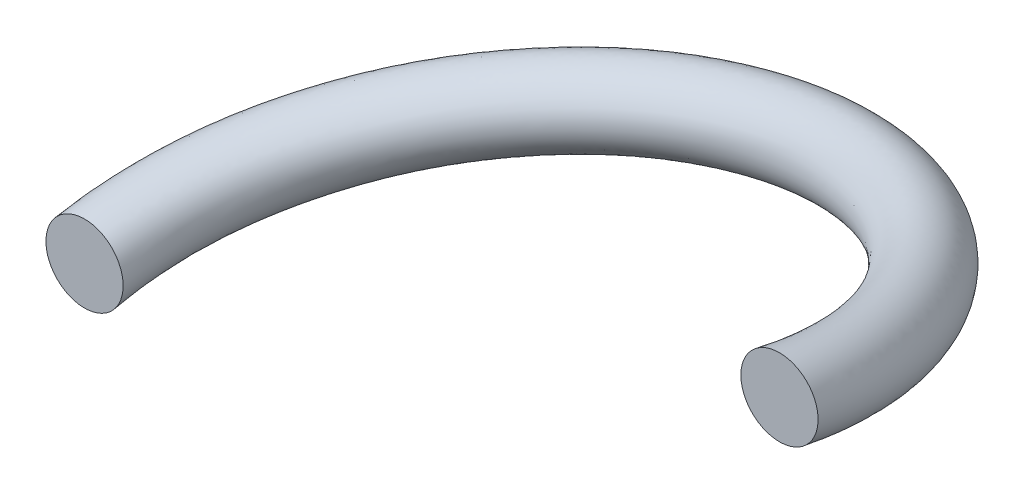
ISO-10303-21;
HEADER;
FILE_DESCRIPTION(('STEP AP214'),'2;1');
FILE_NAME('part.step','',(''),(''),'','','');
FILE_SCHEMA(('AUTOMOTIVE_DESIGN { 1 0 10303 214 1 1 1 1 }'));
ENDSEC;
DATA;
#1=APPLICATION_CONTEXT('core data for automotive mechanical design processes');
#2=APPLICATION_PROTOCOL_DEFINITION('international standard','automotive_design',2000,#1);
#3=PRODUCT_CONTEXT('',#1,'mechanical');
#4=PRODUCT('Part','Part','',(#3));
#5=PRODUCT_RELATED_PRODUCT_CATEGORY('part','',(#4));
#6=PRODUCT_DEFINITION_FORMATION('','',#4);
#7=PRODUCT_DEFINITION_CONTEXT('part definition',#1,'design');
#8=PRODUCT_DEFINITION('design','',#6,#7);
#9=PRODUCT_DEFINITION_SHAPE('','',#8);
#10=(LENGTH_UNIT() NAMED_UNIT(*) SI_UNIT(.MILLI.,.METRE.));
#11=(NAMED_UNIT(*) PLANE_ANGLE_UNIT() SI_UNIT($,.RADIAN.));
#12=(NAMED_UNIT(*) SI_UNIT($,.STERADIAN.) SOLID_ANGLE_UNIT());
#13=UNCERTAINTY_MEASURE_WITH_UNIT(LENGTH_MEASURE(1.E-05),#10,'distance_accuracy_value','');
#14=(GEOMETRIC_REPRESENTATION_CONTEXT(3) GLOBAL_UNCERTAINTY_ASSIGNED_CONTEXT((#13)) GLOBAL_UNIT_ASSIGNED_CONTEXT((#10,
#11,#12)) REPRESENTATION_CONTEXT('',''));
#15=CARTESIAN_POINT('',(0.,0.,0.));
#16=DIRECTION('',(0.,0.,1.));
#17=DIRECTION('',(1.,0.,0.));
#18=AXIS2_PLACEMENT_3D('',#15,#16,#17);
#19=CARTESIAN_POINT('',(-45.,5.,0.));
#20=DIRECTION('',(0.,0.,1.));
#21=DIRECTION('',(1.,0.,0.));
#22=AXIS2_PLACEMENT_3D('',#19,#20,#21);
#23=PLANE('',#22);
#24=CARTESIAN_POINT('',(-45.,5.,0.));
#25=DIRECTION('',(0.,0.,1.));
#26=DIRECTION('',(1.,0.,0.));
#27=AXIS2_PLACEMENT_3D('',#24,#25,#26);
#28=CIRCLE('',#27,5.);
#29=CARTESIAN_POINT('',(-40.,5.,0.));
#30=VERTEX_POINT('',#29);
#31=EDGE_CURVE('E38',#30,#30,#28,.T.);
#32=ORIENTED_EDGE('',*,*,#31,.T.);
#33=EDGE_LOOP('',(#32));
#34=FACE_BOUND('',#33,.T.);
#35=ADVANCED_FACE('F30',(#34),#23,.T.);
#36=CARTESIAN_POINT('',(45.,35.,3.14233320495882E-13));
#37=DIRECTION('',(0.,0.,-1.));
#38=DIRECTION('',(-1.,0.,0.));
#39=AXIS2_PLACEMENT_3D('',#36,#37,#38);
#40=PLANE('',#39);
#41=CARTESIAN_POINT('',(45.,35.,3.14233320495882E-13));
#42=DIRECTION('',(0.,0.,-1.));
#43=DIRECTION('',(-1.,0.,0.));
#44=AXIS2_PLACEMENT_3D('',#41,#42,#43);
#45=CIRCLE('',#44,5.);
#46=CARTESIAN_POINT('',(40.,34.9999999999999,1.84579475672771E-13));
#47=VERTEX_POINT('',#46);
#48=EDGE_CURVE('E11',#47,#47,#45,.T.);
#49=ORIENTED_EDGE('',*,*,#48,.F.);
#50=EDGE_LOOP('',(#49));
#51=FACE_BOUND('',#50,.T.);
#52=ADVANCED_FACE('F64',(#51),#40,.F.);
#53=CARTESIAN_POINT('',(-40.,5.,0.));
#54=CARTESIAN_POINT('',(-40.,7.14285714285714,-9.129738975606));
#55=CARTESIAN_POINT('',(-36.0387547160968,9.28571428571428,-17.3553495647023));
#56=CARTESIAN_POINT('',(-32.0775094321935,11.4285714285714,-25.5809601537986));
#57=CARTESIAN_POINT('',(-24.9395920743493,13.5714285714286,-31.2732592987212));
#58=CARTESIAN_POINT('',(-17.8016747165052,15.7142857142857,-36.9655584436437));
#59=CARTESIAN_POINT('',(-8.90083735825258,17.8571428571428,-38.9971164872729));
#60=CARTESIAN_POINT('',(0.,20.,-41.0286745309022));
#61=CARTESIAN_POINT('',(8.90083735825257,22.1428571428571,-38.9971164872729));
#62=CARTESIAN_POINT('',(17.8016747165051,24.2857142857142,-36.9655584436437));
#63=CARTESIAN_POINT('',(24.9395920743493,26.4285714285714,-31.2732592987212));
#64=CARTESIAN_POINT('',(32.0775094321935,28.5714285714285,-25.5809601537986));
#65=CARTESIAN_POINT('',(36.0387547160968,30.7142857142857,-17.3553495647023));
#66=CARTESIAN_POINT('',(40.,32.8571428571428,-9.129738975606));
#67=CARTESIAN_POINT('',(40.,34.9999999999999,0.));
#68=CARTESIAN_POINT('',(40.,37.1428571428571,9.12973897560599));
#69=CARTESIAN_POINT('',(36.0387547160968,39.2857142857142,17.3553495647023));
#70=CARTESIAN_POINT('',(-40.,15.,0.));
#71=CARTESIAN_POINT('',(-40.,17.1428571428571,-9.129738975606));
#72=CARTESIAN_POINT('',(-36.0387547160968,19.2857142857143,-17.3553495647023));
#73=CARTESIAN_POINT('',(-32.0775094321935,21.4285714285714,-25.5809601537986));
#74=CARTESIAN_POINT('',(-24.9395920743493,23.5714285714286,-31.2732592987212));
#75=CARTESIAN_POINT('',(-17.8016747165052,25.7142857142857,-36.9655584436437));
#76=CARTESIAN_POINT('',(-8.90083735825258,27.8571428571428,-38.9971164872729));
#77=CARTESIAN_POINT('',(0.,30.,-41.0286745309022));
#78=CARTESIAN_POINT('',(8.90083735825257,32.1428571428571,-38.9971164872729));
#79=CARTESIAN_POINT('',(17.8016747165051,34.2857142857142,-36.9655584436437));
#80=CARTESIAN_POINT('',(24.9395920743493,36.4285714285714,-31.2732592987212));
#81=CARTESIAN_POINT('',(32.0775094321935,38.5714285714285,-25.5809601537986));
#82=CARTESIAN_POINT('',(36.0387547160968,40.7142857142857,-17.3553495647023));
#83=CARTESIAN_POINT('',(40.,42.8571428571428,-9.129738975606));
#84=CARTESIAN_POINT('',(40.,44.9999999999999,0.));
#85=CARTESIAN_POINT('',(40.,47.1428571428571,9.12973897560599));
#86=CARTESIAN_POINT('',(36.0387547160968,49.2857142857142,17.3553495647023));
#87=CARTESIAN_POINT('',(-50.,15.,0.));
#88=CARTESIAN_POINT('',(-50.,17.1428571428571,-11.4121737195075));
#89=CARTESIAN_POINT('',(-45.048443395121,19.2857142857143,-21.6941869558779));
#90=CARTESIAN_POINT('',(-40.0968867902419,21.4285714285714,-31.9762001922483));
#91=CARTESIAN_POINT('',(-31.1744900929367,23.5714285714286,-39.0915741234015));
#92=CARTESIAN_POINT('',(-22.2520933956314,25.7142857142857,-46.2069480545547));
#93=CARTESIAN_POINT('',(-11.1260466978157,27.8571428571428,-48.7463956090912));
#94=CARTESIAN_POINT('',(0.,30.,-51.2858431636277));
#95=CARTESIAN_POINT('',(11.1260466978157,32.1428571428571,-48.7463956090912));
#96=CARTESIAN_POINT('',(22.2520933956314,34.2857142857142,-46.2069480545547));
#97=CARTESIAN_POINT('',(31.1744900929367,36.4285714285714,-39.0915741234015));
#98=CARTESIAN_POINT('',(40.0968867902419,38.5714285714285,-31.9762001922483));
#99=CARTESIAN_POINT('',(45.048443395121,40.7142857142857,-21.6941869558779));
#100=CARTESIAN_POINT('',(50.,42.8571428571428,-11.4121737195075));
#101=CARTESIAN_POINT('',(50.,44.9999999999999,0.));
#102=CARTESIAN_POINT('',(50.,47.1428571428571,11.4121737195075));
#103=CARTESIAN_POINT('',(45.048443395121,49.2857142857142,21.6941869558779));
#104=CARTESIAN_POINT('',(-50.,5.,0.));
#105=CARTESIAN_POINT('',(-50.,7.14285714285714,-11.4121737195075));
#106=CARTESIAN_POINT('',(-45.048443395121,9.28571428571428,-21.6941869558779));
#107=CARTESIAN_POINT('',(-40.0968867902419,11.4285714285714,-31.9762001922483));
#108=CARTESIAN_POINT('',(-31.1744900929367,13.5714285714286,-39.0915741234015));
#109=CARTESIAN_POINT('',(-22.2520933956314,15.7142857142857,-46.2069480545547));
#110=CARTESIAN_POINT('',(-11.1260466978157,17.8571428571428,-48.7463956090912));
#111=CARTESIAN_POINT('',(0.,20.,-51.2858431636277));
#112=CARTESIAN_POINT('',(11.1260466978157,22.1428571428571,-48.7463956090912));
#113=CARTESIAN_POINT('',(22.2520933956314,24.2857142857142,-46.2069480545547));
#114=CARTESIAN_POINT('',(31.1744900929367,26.4285714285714,-39.0915741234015));
#115=CARTESIAN_POINT('',(40.0968867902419,28.5714285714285,-31.9762001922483));
#116=CARTESIAN_POINT('',(45.048443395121,30.7142857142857,-21.6941869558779));
#117=CARTESIAN_POINT('',(50.,32.8571428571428,-11.4121737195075));
#118=CARTESIAN_POINT('',(50.,34.9999999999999,0.));
#119=CARTESIAN_POINT('',(50.,37.1428571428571,11.4121737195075));
#120=CARTESIAN_POINT('',(45.048443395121,39.2857142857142,21.6941869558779));
#121=CARTESIAN_POINT('',(-50.,-5.00000000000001,0.));
#122=CARTESIAN_POINT('',(-50.,-2.85714285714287,-11.4121737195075));
#123=CARTESIAN_POINT('',(-45.048443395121,-0.71428571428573,-21.6941869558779));
#124=CARTESIAN_POINT('',(-40.0968867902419,1.42857142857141,-31.9762001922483));
#125=CARTESIAN_POINT('',(-31.1744900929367,3.57142857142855,-39.0915741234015));
#126=CARTESIAN_POINT('',(-22.2520933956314,5.71428571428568,-46.2069480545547));
#127=CARTESIAN_POINT('',(-11.1260466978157,7.85714285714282,-48.7463956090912));
#128=CARTESIAN_POINT('',(0.,9.99999999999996,-51.2858431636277));
#129=CARTESIAN_POINT('',(11.1260466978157,12.1428571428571,-48.7463956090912));
#130=CARTESIAN_POINT('',(22.2520933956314,14.2857142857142,-46.2069480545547));
#131=CARTESIAN_POINT('',(31.1744900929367,16.4285714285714,-39.0915741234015));
#132=CARTESIAN_POINT('',(40.0968867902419,18.5714285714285,-31.9762001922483));
#133=CARTESIAN_POINT('',(45.048443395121,20.7142857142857,-21.6941869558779));
#134=CARTESIAN_POINT('',(50.,22.8571428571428,-11.4121737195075));
#135=CARTESIAN_POINT('',(50.,24.9999999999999,0.));
#136=CARTESIAN_POINT('',(50.,27.1428571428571,11.4121737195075));
#137=CARTESIAN_POINT('',(45.048443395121,29.2857142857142,21.6941869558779));
#138=CARTESIAN_POINT('',(-40.,-5.00000000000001,0.));
#139=CARTESIAN_POINT('',(-40.,-2.85714285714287,-9.129738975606));
#140=CARTESIAN_POINT('',(-36.0387547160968,-0.714285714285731,-17.3553495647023));
#141=CARTESIAN_POINT('',(-32.0775094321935,1.42857142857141,-25.5809601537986));
#142=CARTESIAN_POINT('',(-24.9395920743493,3.57142857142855,-31.2732592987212));
#143=CARTESIAN_POINT('',(-17.8016747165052,5.71428571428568,-36.9655584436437));
#144=CARTESIAN_POINT('',(-8.90083735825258,7.85714285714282,-38.9971164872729));
#145=CARTESIAN_POINT('',(0.,9.99999999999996,-41.0286745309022));
#146=CARTESIAN_POINT('',(8.90083735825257,12.1428571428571,-38.9971164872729));
#147=CARTESIAN_POINT('',(17.8016747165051,14.2857142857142,-36.9655584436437));
#148=CARTESIAN_POINT('',(24.9395920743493,16.4285714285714,-31.2732592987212));
#149=CARTESIAN_POINT('',(32.0775094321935,18.5714285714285,-25.5809601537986));
#150=CARTESIAN_POINT('',(36.0387547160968,20.7142857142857,-17.3553495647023));
#151=CARTESIAN_POINT('',(40.,22.8571428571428,-9.129738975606));
#152=CARTESIAN_POINT('',(40.,24.9999999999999,0.));
#153=CARTESIAN_POINT('',(40.,27.1428571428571,9.12973897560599));
#154=CARTESIAN_POINT('',(36.0387547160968,29.2857142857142,17.3553495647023));
#155=CARTESIAN_POINT('',(-40.,5.,0.));
#156=CARTESIAN_POINT('',(-40.,7.14285714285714,-9.129738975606));
#157=CARTESIAN_POINT('',(-36.0387547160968,9.28571428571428,-17.3553495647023));
#158=CARTESIAN_POINT('',(-32.0775094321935,11.4285714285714,-25.5809601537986));
#159=CARTESIAN_POINT('',(-24.9395920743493,13.5714285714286,-31.2732592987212));
#160=CARTESIAN_POINT('',(-17.8016747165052,15.7142857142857,-36.9655584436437));
#161=CARTESIAN_POINT('',(-8.90083735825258,17.8571428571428,-38.9971164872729));
#162=CARTESIAN_POINT('',(0.,20.,-41.0286745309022));
#163=CARTESIAN_POINT('',(8.90083735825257,22.1428571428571,-38.9971164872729));
#164=CARTESIAN_POINT('',(17.8016747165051,24.2857142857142,-36.9655584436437));
#165=CARTESIAN_POINT('',(24.9395920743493,26.4285714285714,-31.2732592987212));
#166=CARTESIAN_POINT('',(32.0775094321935,28.5714285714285,-25.5809601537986));
#167=CARTESIAN_POINT('',(36.0387547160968,30.7142857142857,-17.3553495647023));
#168=CARTESIAN_POINT('',(40.,32.8571428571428,-9.129738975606));
#169=CARTESIAN_POINT('',(40.,34.9999999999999,0.));
#170=CARTESIAN_POINT('',(40.,37.1428571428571,9.12973897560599));
#171=CARTESIAN_POINT('',(36.0387547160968,39.2857142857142,17.3553495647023));
#172=(BOUNDED_SURFACE() B_SPLINE_SURFACE(3,2,((#53,#54,#55,#56,#57,#58,#59,#60,#61,#62,#63,#64,
#65,#66,#67,#68,#69),(#70,#71,#72,#73,#74,#75,#76,#77,#78,#79,#80,#81,#82,#83,#84,#85,#86),(#87,
#88,#89,#90,#91,#92,#93,#94,#95,#96,#97,#98,#99,#100,#101,#102,#103),(#104,#105,#106,#107,#108,
#109,#110,#111,#112,#113,#114,#115,#116,#117,#118,#119,#120),(#121,#122,#123,#124,#125,#126,
#127,#128,#129,#130,#131,#132,#133,#134,#135,#136,#137),(#138,#139,#140,#141,#142,#143,#144,
#145,#146,#147,#148,#149,#150,#151,#152,#153,#154),(#155,#156,#157,#158,#159,#160,#161,#162,
#163,#164,#165,#166,#167,#168,#169,#170,#171)),.UNSPECIFIED.,.T.,.F.,
.F.) B_SPLINE_SURFACE_WITH_KNOTS((4,3,4),(3,2,2,2,2,2,2,2,3),(0.,0.5,1.),(0.,0.125,0.25,0.375,
0.5,0.625,0.75,0.875,1.),
.UNSPECIFIED.) GEOMETRIC_REPRESENTATION_ITEM() RATIONAL_B_SPLINE_SURFACE(((1.,0.974927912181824,
1.,0.974927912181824,1.,0.974927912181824,1.,0.974927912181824,1.,0.974927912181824,1.,
0.974927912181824,1.,0.974927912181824,1.,0.974927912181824,1.),(0.333333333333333,
0.324975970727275,0.333333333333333,0.324975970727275,0.333333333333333,0.324975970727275,
0.333333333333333,0.324975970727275,0.333333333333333,0.324975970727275,0.333333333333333,
0.324975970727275,0.333333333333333,0.324975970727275,0.333333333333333,0.324975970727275,
0.333333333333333),(0.333333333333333,0.324975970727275,0.333333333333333,0.324975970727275,
0.333333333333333,0.324975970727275,0.333333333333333,0.324975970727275,0.333333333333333,
0.324975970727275,0.333333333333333,0.324975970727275,0.333333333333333,0.324975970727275,
0.333333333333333,0.324975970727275,0.333333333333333),(1.,0.974927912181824,1.,
0.974927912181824,1.,0.974927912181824,1.,0.974927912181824,1.,0.974927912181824,1.,
0.974927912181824,1.,0.974927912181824,1.,0.974927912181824,1.),(0.333333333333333,
0.324975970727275,0.333333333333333,0.324975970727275,0.333333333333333,0.324975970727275,
0.333333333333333,0.324975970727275,0.333333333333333,0.324975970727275,0.333333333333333,
0.324975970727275,0.333333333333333,0.324975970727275,0.333333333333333,0.324975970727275,
0.333333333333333),(0.333333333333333,0.324975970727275,0.333333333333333,0.324975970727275,
0.333333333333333,0.324975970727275,0.333333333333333,0.324975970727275,0.333333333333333,
0.324975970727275,0.333333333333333,0.324975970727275,0.333333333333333,0.324975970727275,
0.333333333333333,0.324975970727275,0.333333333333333),(1.,0.974927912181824,1.,
0.974927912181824,1.,0.974927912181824,1.,0.974927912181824,1.,0.974927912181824,1.,
0.974927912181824,1.,0.974927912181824,1.,0.974927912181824,1.))) REPRESENTATION_ITEM('') SURFACE());
#173=ORIENTED_EDGE('',*,*,#48,.T.);
#174=EDGE_LOOP('',(#173));
#175=FACE_BOUND('',#174,.T.);
#176=ORIENTED_EDGE('',*,*,#31,.F.);
#177=EDGE_LOOP('',(#176));
#178=FACE_BOUND('',#177,.T.);
#179=ADVANCED_FACE('F46',(#175,#178),#172,.F.);
#180=CLOSED_SHELL('',(#35,#52,#179));
#181=MANIFOLD_SOLID_BREP('B2',#180);
#182=ADVANCED_BREP_SHAPE_REPRESENTATION('',(#18,#181),#14);
#183=SHAPE_DEFINITION_REPRESENTATION(#9,#182);
ENDSEC;
END-ISO-10303-21;
